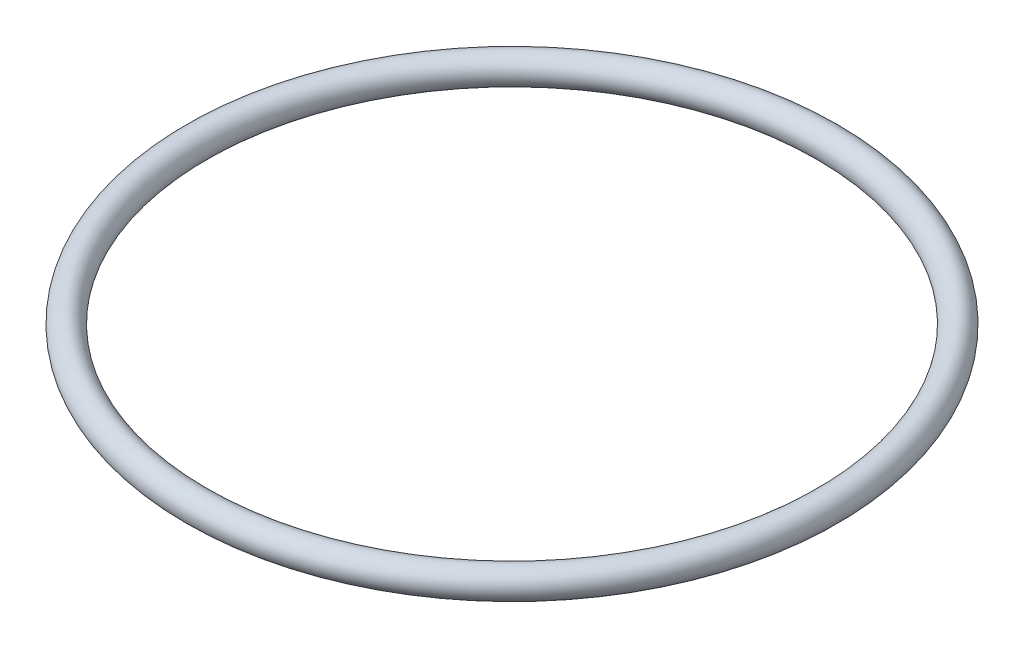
ISO-10303-21;
HEADER;
FILE_DESCRIPTION(('STEP AP214'),'2;1');
FILE_NAME('part.step','',(''),(''),'','','');
FILE_SCHEMA(('AUTOMOTIVE_DESIGN { 1 0 10303 214 1 1 1 1 }'));
ENDSEC;
DATA;
#1=APPLICATION_CONTEXT('core data for automotive mechanical design processes');
#2=APPLICATION_PROTOCOL_DEFINITION('international standard','automotive_design',2000,#1);
#3=PRODUCT_CONTEXT('',#1,'mechanical');
#4=PRODUCT('Part','Part','',(#3));
#5=PRODUCT_RELATED_PRODUCT_CATEGORY('part','',(#4));
#6=PRODUCT_DEFINITION_FORMATION('','',#4);
#7=PRODUCT_DEFINITION_CONTEXT('part definition',#1,'design');
#8=PRODUCT_DEFINITION('design','',#6,#7);
#9=PRODUCT_DEFINITION_SHAPE('','',#8);
#10=(LENGTH_UNIT() NAMED_UNIT(*) SI_UNIT(.MILLI.,.METRE.));
#11=(NAMED_UNIT(*) PLANE_ANGLE_UNIT() SI_UNIT($,.RADIAN.));
#12=(NAMED_UNIT(*) SI_UNIT($,.STERADIAN.) SOLID_ANGLE_UNIT());
#13=UNCERTAINTY_MEASURE_WITH_UNIT(LENGTH_MEASURE(1.E-05),#10,'distance_accuracy_value','');
#14=(GEOMETRIC_REPRESENTATION_CONTEXT(3) GLOBAL_UNCERTAINTY_ASSIGNED_CONTEXT((#13)) GLOBAL_UNIT_ASSIGNED_CONTEXT((#10,
#11,#12)) REPRESENTATION_CONTEXT('',''));
#15=CARTESIAN_POINT('',(0.,0.,0.));
#16=DIRECTION('',(0.,0.,1.));
#17=DIRECTION('',(1.,0.,0.));
#18=AXIS2_PLACEMENT_3D('',#15,#16,#17);
#19=CARTESIAN_POINT('',(0.,1.25,0.));
#20=DIRECTION('',(0.,-1.,0.));
#21=DIRECTION('',(0.,0.,-1.));
#22=AXIS2_PLACEMENT_3D('',#19,#20,#21);
#23=TOROIDAL_SURFACE('',#22,22.,1.);
#24=CARTESIAN_POINT('',(0.,1.25,-23.));
#25=VERTEX_POINT('',#24);
#26=VERTEX_LOOP('',#25);
#27=FACE_BOUND('',#26,.T.);
#28=ADVANCED_FACE('F22',(#27),#23,.T.);
#29=CLOSED_SHELL('',(#28));
#30=MANIFOLD_SOLID_BREP('B2',#29);
#31=ADVANCED_BREP_SHAPE_REPRESENTATION('',(#18,#30),#14);
#32=SHAPE_DEFINITION_REPRESENTATION(#9,#31);
ENDSEC;
END-ISO-10303-21;
